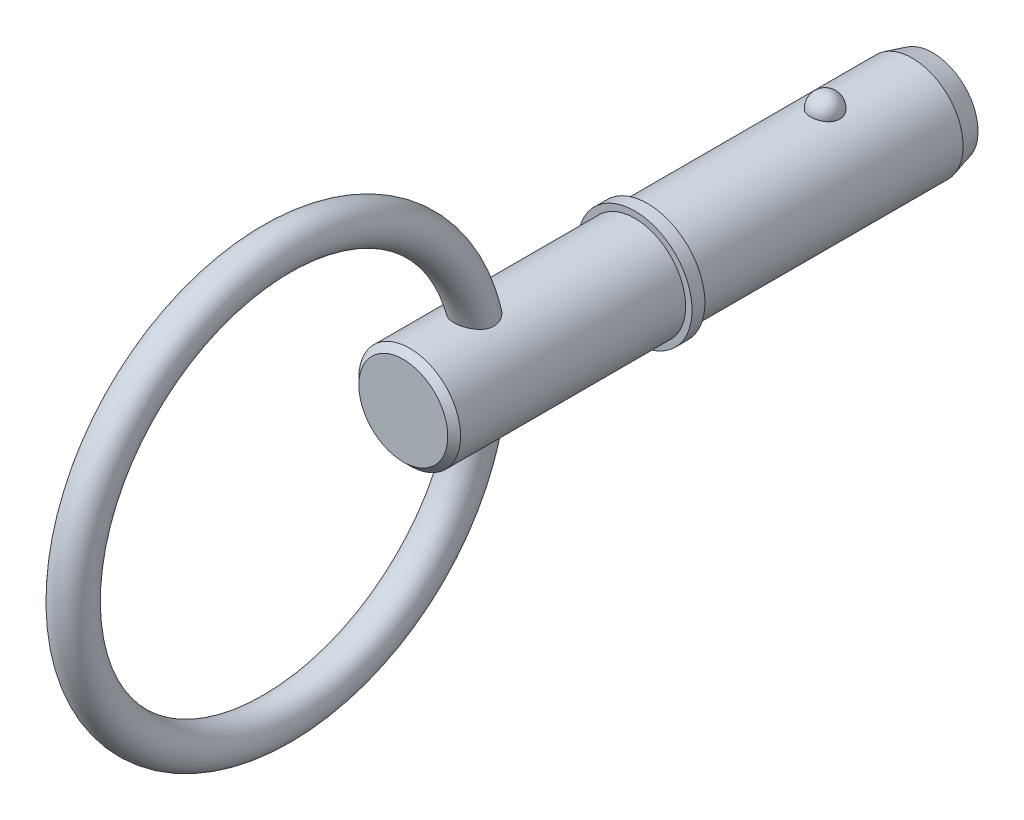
ISO-10303-21;
HEADER;
FILE_DESCRIPTION(('STEP AP214'),'2;1');
FILE_NAME('part.step','',(''),(''),'','','');
FILE_SCHEMA(('AUTOMOTIVE_DESIGN { 1 0 10303 214 1 1 1 1 }'));
ENDSEC;
DATA;
#1=APPLICATION_CONTEXT('core data for automotive mechanical design processes');
#2=APPLICATION_PROTOCOL_DEFINITION('international standard','automotive_design',2000,#1);
#3=PRODUCT_CONTEXT('',#1,'mechanical');
#4=PRODUCT('Part','Part','',(#3));
#5=PRODUCT_RELATED_PRODUCT_CATEGORY('part','',(#4));
#6=PRODUCT_DEFINITION_FORMATION('','',#4);
#7=PRODUCT_DEFINITION_CONTEXT('part definition',#1,'design');
#8=PRODUCT_DEFINITION('design','',#6,#7);
#9=PRODUCT_DEFINITION_SHAPE('','',#8);
#10=(LENGTH_UNIT() NAMED_UNIT(*) SI_UNIT(.MILLI.,.METRE.));
#11=(NAMED_UNIT(*) PLANE_ANGLE_UNIT() SI_UNIT($,.RADIAN.));
#12=(NAMED_UNIT(*) SI_UNIT($,.STERADIAN.) SOLID_ANGLE_UNIT());
#13=UNCERTAINTY_MEASURE_WITH_UNIT(LENGTH_MEASURE(1.E-05),#10,'distance_accuracy_value','');
#14=(GEOMETRIC_REPRESENTATION_CONTEXT(3) GLOBAL_UNCERTAINTY_ASSIGNED_CONTEXT((#13)) GLOBAL_UNIT_ASSIGNED_CONTEXT((#10,
#11,#12)) REPRESENTATION_CONTEXT('',''));
#15=CARTESIAN_POINT('',(0.,0.,0.));
#16=DIRECTION('',(0.,0.,1.));
#17=DIRECTION('',(1.,0.,0.));
#18=AXIS2_PLACEMENT_3D('',#15,#16,#17);
#19=CARTESIAN_POINT('',(0.,0.,12.7));
#20=DIRECTION('',(0.,0.,-1.));
#21=DIRECTION('',(-1.,0.,0.));
#22=AXIS2_PLACEMENT_3D('',#19,#20,#21);
#23=CYLINDRICAL_SURFACE('',#22,3.97);
#24=CARTESIAN_POINT('',(1.13787398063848,3.80343828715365,-1.15000000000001));
#25=CARTESIAN_POINT('',(1.13787307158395,3.80343910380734,-1.08573978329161));
#26=CARTESIAN_POINT('',(1.13264657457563,3.80501406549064,-1.02146820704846));
#27=CARTESIAN_POINT('',(1.11186534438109,3.81113760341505,-0.894749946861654));
#28=CARTESIAN_POINT('',(1.09630734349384,3.81568712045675,-0.832303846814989));
#29=CARTESIAN_POINT('',(1.05525533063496,3.82724281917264,-0.711040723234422));
#30=CARTESIAN_POINT('',(1.02976565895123,3.83424792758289,-0.652222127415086));
#31=CARTESIAN_POINT('',(0.969477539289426,3.84993235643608,-0.539814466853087));
#32=CARTESIAN_POINT('',(0.934679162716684,3.85861166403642,-0.486225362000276));
#33=CARTESIAN_POINT('',(0.856427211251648,3.87673176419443,-0.385470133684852));
#34=CARTESIAN_POINT('',(0.812928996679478,3.88617632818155,-0.338339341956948));
#35=CARTESIAN_POINT('',(0.718506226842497,3.90473543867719,-0.252134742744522));
#36=CARTESIAN_POINT('',(0.667581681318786,3.91384998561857,-0.213060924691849));
#37=CARTESIAN_POINT('',(0.559829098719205,3.93070626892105,-0.144169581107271));
#38=CARTESIAN_POINT('',(0.503019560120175,3.93845211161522,-0.1143241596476));
#39=CARTESIAN_POINT('',(0.384957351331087,3.95173781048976,-0.0645874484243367));
#40=CARTESIAN_POINT('',(0.323705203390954,3.95727792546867,-0.0446949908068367));
#41=CARTESIAN_POINT('',(0.199749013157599,3.96544869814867,-0.0157294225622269));
#42=CARTESIAN_POINT('',(0.137095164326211,3.96813298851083,-0.00645660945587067));
#43=CARTESIAN_POINT('',(0.011061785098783,3.97048461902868,0.00167939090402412));
#44=CARTESIAN_POINT('',(-0.052317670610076,3.97015226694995,0.000543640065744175));
#45=CARTESIAN_POINT('',(-0.176983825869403,3.96653606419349,-0.0120046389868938));
#46=CARTESIAN_POINT('',(-0.238287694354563,3.96329719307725,-0.0232605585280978));
#47=CARTESIAN_POINT('',(-0.358077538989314,3.95427494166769,-0.0555133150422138));
#48=CARTESIAN_POINT('',(-0.41656346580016,3.94849151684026,-0.0765103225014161));
#49=CARTESIAN_POINT('',(-0.529474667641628,3.9349475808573,-0.127824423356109));
#50=CARTESIAN_POINT('',(-0.583873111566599,3.92717527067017,-0.158197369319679));
#51=CARTESIAN_POINT('',(-0.68679616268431,3.9104901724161,-0.227402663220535));
#52=CARTESIAN_POINT('',(-0.73532013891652,3.90157726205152,-0.266235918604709));
#53=CARTESIAN_POINT('',(-0.826197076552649,3.88336108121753,-0.35221079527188));
#54=CARTESIAN_POINT('',(-0.868404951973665,3.87405356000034,-0.399504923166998));
#55=CARTESIAN_POINT('',(-0.944393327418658,3.85623507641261,-0.500572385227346));
#56=CARTESIAN_POINT('',(-0.978173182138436,3.84772417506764,-0.554346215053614));
#57=CARTESIAN_POINT('',(-1.036841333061,3.83233550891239,-0.667624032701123));
#58=CARTESIAN_POINT('',(-1.06161430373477,3.82547928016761,-0.727190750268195));
#59=CARTESIAN_POINT('',(-1.1010562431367,3.81431496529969,-0.849806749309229));
#60=CARTESIAN_POINT('',(-1.11572551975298,3.81000680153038,-0.912855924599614));
#61=CARTESIAN_POINT('',(-1.13455293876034,3.80444307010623,-1.04035299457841));
#62=CARTESIAN_POINT('',(-1.13875701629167,3.80317416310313,-1.10479351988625));
#63=CARTESIAN_POINT('',(-1.13668244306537,3.80379469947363,-1.23348881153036));
#64=CARTESIAN_POINT('',(-1.13040410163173,3.80568404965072,-1.29774358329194));
#65=CARTESIAN_POINT('',(-1.10758455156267,3.81238701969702,-1.42388263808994));
#66=CARTESIAN_POINT('',(-1.09109911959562,3.81718474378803,-1.48577787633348));
#67=CARTESIAN_POINT('',(-1.04831897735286,3.82915360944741,-1.60583632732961));
#68=CARTESIAN_POINT('',(-1.02202385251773,3.83632485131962,-1.66399938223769));
#69=CARTESIAN_POINT('',(-0.960087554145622,3.85229234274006,-1.7753167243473));
#70=CARTESIAN_POINT('',(-0.924393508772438,3.86109769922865,-1.82844028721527));
#71=CARTESIAN_POINT('',(-0.844617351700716,3.87932868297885,-1.92784641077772));
#72=CARTESIAN_POINT('',(-0.800534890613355,3.88875433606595,-1.97412868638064));
#73=CARTESIAN_POINT('',(-0.704909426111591,3.90722138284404,-2.05875748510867));
#74=CARTESIAN_POINT('',(-0.653336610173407,3.91626104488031,-2.09707073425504));
#75=CARTESIAN_POINT('',(-0.544251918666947,3.93290335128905,-2.16444159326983));
#76=CARTESIAN_POINT('',(-0.486740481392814,3.94050610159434,-2.19349988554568));
#77=CARTESIAN_POINT('',(-0.3681866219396,3.95333328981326,-2.24120607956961));
#78=CARTESIAN_POINT('',(-0.307200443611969,3.9585876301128,-2.25998559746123));
#79=CARTESIAN_POINT('',(-0.182787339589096,3.96627905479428,-2.28716436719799));
#80=CARTESIAN_POINT('',(-0.119360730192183,3.96871650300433,-2.29556495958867));
#81=CARTESIAN_POINT('',(0.0067634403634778,3.97048518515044,-2.30167748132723));
#82=CARTESIAN_POINT('',(0.0694499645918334,3.96987797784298,-2.299601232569));
#83=CARTESIAN_POINT('',(0.193555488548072,3.96576491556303,-2.28530777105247));
#84=CARTESIAN_POINT('',(0.254974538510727,3.96225917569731,-2.27309096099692));
#85=CARTESIAN_POINT('',(0.374550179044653,3.95274547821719,-2.2389384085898));
#86=CARTESIAN_POINT('',(0.432719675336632,3.94674835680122,-2.21704472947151));
#87=CARTESIAN_POINT('',(0.544514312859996,3.93288448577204,-2.16414952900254));
#88=CARTESIAN_POINT('',(0.598139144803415,3.92501760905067,-2.13314738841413));
#89=CARTESIAN_POINT('',(0.700284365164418,3.90809781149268,-2.06228741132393));
#90=CARTESIAN_POINT('',(0.748708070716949,3.89902775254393,-2.02229434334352));
#91=CARTESIAN_POINT('',(0.838215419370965,3.88077133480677,-1.93481443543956));
#92=CARTESIAN_POINT('',(0.879297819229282,3.87158495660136,-1.88732632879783));
#93=CARTESIAN_POINT('',(0.953804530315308,3.85391414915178,-1.78516284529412));
#94=CARTESIAN_POINT('',(0.987071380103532,3.8454460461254,-1.73036973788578));
#95=CARTESIAN_POINT('',(1.04410491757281,3.83035507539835,-1.61582422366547));
#96=CARTESIAN_POINT('',(1.06787445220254,3.82373165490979,-1.55607330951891));
#97=CARTESIAN_POINT('',(1.10358064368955,3.813570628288,-1.43904746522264));
#98=CARTESIAN_POINT('',(1.11641754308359,3.80980198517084,-1.38206535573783));
#99=CARTESIAN_POINT('',(1.13356451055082,3.80473547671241,-1.26672526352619));
#100=CARTESIAN_POINT('',(1.13787480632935,3.80343754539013,-1.20836731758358));
#101=CARTESIAN_POINT('',(1.13787398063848,3.80343828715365,-1.15000000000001));
#102=B_SPLINE_CURVE_WITH_KNOTS('',3,(#24,#25,#26,#27,#28,#29,#30,#31,#32,#33,#34,#35,#36,#37,
#38,#39,#40,#41,#42,#43,#44,#45,#46,#47,#48,#49,#50,#51,#52,#53,#54,#55,#56,#57,#58,#59,#60,#61,
#62,#63,#64,#65,#66,#67,#68,#69,#70,#71,#72,#73,#74,#75,#76,#77,#78,#79,#80,#81,#82,#83,#84,#85,
#86,#87,#88,#89,#90,#91,#92,#93,#94,#95,#96,#97,#98,#99,#100,#101),.UNSPECIFIED.,.T.,.F.,(4,2,2,
2,2,2,2,2,2,2,2,2,2,2,2,2,2,2,2,2,2,2,2,2,2,2,2,2,2,2,2,2,2,2,2,2,2,2,4),(0.,0.192571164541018,
0.385203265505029,0.577751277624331,0.770297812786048,0.963858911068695,1.15741975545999,
1.35038964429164,1.54333688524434,1.73259288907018,1.92182958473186,2.10818732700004,
2.2945483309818,2.48204164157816,2.66955507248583,2.86087083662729,3.05220124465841,
3.24590171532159,3.43959628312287,3.63243915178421,3.82527632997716,4.01706893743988,
4.20886965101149,4.40177324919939,4.59468488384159,4.78838651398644,4.9820738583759,
5.17321934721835,5.36434014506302,5.55161251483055,5.7388774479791,5.9253362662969,
6.11180776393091,6.30129785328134,6.49082000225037,6.68388392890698,6.87688993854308,
7.05180628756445,7.22671796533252),.UNSPECIFIED.);
#103=CARTESIAN_POINT('',(1.13787398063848,3.80343828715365,-1.15000000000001));
#104=VERTEX_POINT('',#103);
#105=EDGE_CURVE('E102',#104,#104,#102,.T.);
#106=ORIENTED_EDGE('',*,*,#105,.T.);
#107=EDGE_LOOP('',(#106));
#108=FACE_BOUND('',#107,.T.);
#109=CARTESIAN_POINT('',(0.,0.,-7.94399999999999));
#110=DIRECTION('',(0.,0.,-1.));
#111=DIRECTION('',(-1.,0.,0.));
#112=AXIS2_PLACEMENT_3D('',#109,#110,#111);
#113=CIRCLE('',#112,3.97);
#114=CARTESIAN_POINT('',(-3.97,0.,-7.94399999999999));
#115=VERTEX_POINT('',#114);
#116=EDGE_CURVE('E109',#115,#115,#113,.F.);
#117=ORIENTED_EDGE('',*,*,#116,.T.);
#118=EDGE_LOOP('',(#117));
#119=FACE_BOUND('',#118,.T.);
#120=CARTESIAN_POINT('',(0.,0.,12.7));
#121=DIRECTION('',(0.,0.,1.));
#122=DIRECTION('',(1.,0.,0.));
#123=AXIS2_PLACEMENT_3D('',#120,#121,#122);
#124=CIRCLE('',#123,3.97);
#125=CARTESIAN_POINT('',(3.97,0.,12.7));
#126=VERTEX_POINT('',#125);
#127=EDGE_CURVE('E107',#126,#126,#124,.T.);
#128=ORIENTED_EDGE('',*,*,#127,.F.);
#129=EDGE_LOOP('',(#128));
#130=FACE_BOUND('',#129,.T.);
#131=ADVANCED_FACE('F39',(#108,#119,#130),#23,.T.);
#132=CARTESIAN_POINT('',(0.,0.,-9.53));
#133=DIRECTION('',(0.,0.,-1.));
#134=DIRECTION('',(-1.,0.,0.));
#135=AXIS2_PLACEMENT_3D('',#132,#133,#134);
#136=PLANE('',#135);
#137=CARTESIAN_POINT('',(0.,0.,-9.53));
#138=DIRECTION('',(0.,0.,-1.));
#139=DIRECTION('',(-1.,0.,0.));
#140=AXIS2_PLACEMENT_3D('',#137,#138,#139);
#141=CIRCLE('',#140,3.54503258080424);
#142=CARTESIAN_POINT('',(-3.54503258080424,0.,-9.53));
#143=VERTEX_POINT('',#142);
#144=EDGE_CURVE('E141',#143,#143,#141,.T.);
#145=ORIENTED_EDGE('',*,*,#144,.T.);
#146=EDGE_LOOP('',(#145));
#147=FACE_BOUND('',#146,.T.);
#148=ADVANCED_FACE('F88',(#147),#136,.T.);
#149=CARTESIAN_POINT('',(0.,0.,-9.53));
#150=DIRECTION('',(0.,0.,1.));
#151=DIRECTION('',(1.,0.,0.));
#152=AXIS2_PLACEMENT_3D('',#149,#150,#151);
#153=CONICAL_SURFACE('',#152,3.54503258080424,0.261799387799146);
#154=ORIENTED_EDGE('',*,*,#116,.F.);
#155=EDGE_LOOP('',(#154));
#156=FACE_BOUND('',#155,.T.);
#157=ORIENTED_EDGE('',*,*,#144,.F.);
#158=EDGE_LOOP('',(#157));
#159=FACE_BOUND('',#158,.T.);
#160=ADVANCED_FACE('F94',(#156,#159),#153,.T.);
#161=CARTESIAN_POINT('',(0.,3.97,-1.15000000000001));
#162=DIRECTION('',(0.,1.,0.));
#163=DIRECTION('',(0.,0.,1.));
#164=AXIS2_PLACEMENT_3D('',#161,#162,#163);
#165=SPHERICAL_SURFACE('',#164,1.15);
#166=ORIENTED_EDGE('',*,*,#105,.F.);
#167=EDGE_LOOP('',(#166));
#168=FACE_BOUND('',#167,.T.);
#169=ADVANCED_FACE('F112',(#168),#165,.T.);
#170=CARTESIAN_POINT('',(0.,0.,12.7));
#171=DIRECTION('',(0.,0.,-1.));
#172=DIRECTION('',(-1.,0.,0.));
#173=AXIS2_PLACEMENT_3D('',#170,#171,#172);
#174=PLANE('',#173);
#175=ORIENTED_EDGE('',*,*,#127,.T.);
#176=EDGE_LOOP('',(#175));
#177=FACE_BOUND('',#176,.T.);
#178=CARTESIAN_POINT('',(0.,0.,12.7));
#179=DIRECTION('',(0.,0.,-1.));
#180=DIRECTION('',(-1.,0.,0.));
#181=AXIS2_PLACEMENT_3D('',#178,#179,#180);
#182=CIRCLE('',#181,4.47);
#183=CARTESIAN_POINT('',(-4.47,0.,12.7));
#184=VERTEX_POINT('',#183);
#185=EDGE_CURVE('E108',#184,#184,#182,.T.);
#186=ORIENTED_EDGE('',*,*,#185,.T.);
#187=EDGE_LOOP('',(#186));
#188=FACE_BOUND('',#187,.T.);
#189=ADVANCED_FACE('F116',(#177,#188),#174,.T.);
#190=CARTESIAN_POINT('',(0.,0.,33.7287874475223));
#191=DIRECTION('',(0.,0.,-1.));
#192=DIRECTION('',(-1.,0.,0.));
#193=AXIS2_PLACEMENT_3D('',#190,#191,#192);
#194=CYLINDRICAL_SURFACE('',#193,4.47);
#195=CARTESIAN_POINT('',(0.,0.,13.7));
#196=DIRECTION('',(0.,0.,-1.));
#197=DIRECTION('',(-1.,0.,0.));
#198=AXIS2_PLACEMENT_3D('',#195,#196,#197);
#199=CIRCLE('',#198,4.47);
#200=CARTESIAN_POINT('',(-4.47,0.,13.7));
#201=VERTEX_POINT('',#200);
#202=EDGE_CURVE('E133',#201,#201,#199,.T.);
#203=ORIENTED_EDGE('',*,*,#202,.T.);
#204=EDGE_LOOP('',(#203));
#205=FACE_BOUND('',#204,.T.);
#206=ORIENTED_EDGE('',*,*,#185,.F.);
#207=EDGE_LOOP('',(#206));
#208=FACE_BOUND('',#207,.T.);
#209=ADVANCED_FACE('F120',(#205,#208),#194,.T.);
#210=CARTESIAN_POINT('',(0.,4.47,13.7));
#211=DIRECTION('',(0.,0.,1.));
#212=DIRECTION('',(1.,0.,0.));
#213=AXIS2_PLACEMENT_3D('',#210,#211,#212);
#214=PLANE('',#213);
#215=CARTESIAN_POINT('',(0.,0.,13.7));
#216=DIRECTION('',(0.,0.,1.));
#217=DIRECTION('',(1.,0.,0.));
#218=AXIS2_PLACEMENT_3D('',#215,#216,#217);
#219=CIRCLE('',#218,3.97);
#220=CARTESIAN_POINT('',(3.97,0.,13.7));
#221=VERTEX_POINT('',#220);
#222=EDGE_CURVE('E111',#221,#221,#219,.T.);
#223=ORIENTED_EDGE('',*,*,#222,.F.);
#224=EDGE_LOOP('',(#223));
#225=FACE_BOUND('',#224,.T.);
#226=ORIENTED_EDGE('',*,*,#202,.F.);
#227=EDGE_LOOP('',(#226));
#228=FACE_BOUND('',#227,.T.);
#229=ADVANCED_FACE('F85',(#225,#228),#214,.T.);
#230=CARTESIAN_POINT('',(0.,0.,31.75));
#231=DIRECTION('',(0.,0.,-1.));
#232=DIRECTION('',(-1.,0.,0.));
#233=AXIS2_PLACEMENT_3D('',#230,#231,#232);
#234=CYLINDRICAL_SURFACE('',#233,3.97);
#235=CARTESIAN_POINT('',(-0.740636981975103,-3.90030215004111,24.8942081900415));
#236=CARTESIAN_POINT('',(-0.667733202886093,-3.91414543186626,24.854930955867));
#237=CARTESIAN_POINT('',(-0.591347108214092,-3.92651643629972,24.8215983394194));
#238=CARTESIAN_POINT('',(-0.433709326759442,-3.94703799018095,24.7675410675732));
#239=CARTESIAN_POINT('',(-0.352458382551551,-3.95518918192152,24.7468144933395));
#240=CARTESIAN_POINT('',(-0.187320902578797,-3.96644185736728,24.7184263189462));
#241=CARTESIAN_POINT('',(-0.10343312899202,-3.9695409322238,24.7107709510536));
#242=CARTESIAN_POINT('',(0.0645297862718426,-3.97036376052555,24.7087268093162));
#243=CARTESIAN_POINT('',(0.148604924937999,-3.96808759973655,24.7143378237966));
#244=CARTESIAN_POINT('',(0.313967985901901,-3.95842655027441,24.7386101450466));
#245=CARTESIAN_POINT('',(0.395270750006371,-3.95107581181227,24.7571842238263));
#246=CARTESIAN_POINT('',(0.553418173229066,-3.93204472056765,24.8068699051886));
#247=CARTESIAN_POINT('',(0.630262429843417,-3.92036397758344,24.8379826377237));
#248=CARTESIAN_POINT('',(0.777983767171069,-3.89375421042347,24.9123739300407));
#249=CARTESIAN_POINT('',(0.848809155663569,-3.8788003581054,24.9557462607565));
#250=CARTESIAN_POINT('',(0.981880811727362,-3.84727071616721,25.0536515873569));
#251=CARTESIAN_POINT('',(1.04412630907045,-3.83069478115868,25.1081855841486));
#252=CARTESIAN_POINT('',(1.15846819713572,-3.79768496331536,25.2274397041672));
#253=CARTESIAN_POINT('',(1.21053047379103,-3.78125172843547,25.2921927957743));
#254=CARTESIAN_POINT('',(1.30266807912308,-3.75050988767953,25.4301698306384));
#255=CARTESIAN_POINT('',(1.34274789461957,-3.73620048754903,25.5033905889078));
#256=CARTESIAN_POINT('',(1.40857853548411,-3.71187334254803,25.6536278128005));
#257=CARTESIAN_POINT('',(1.43477198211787,-3.70172571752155,25.7304292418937));
#258=CARTESIAN_POINT('',(1.47426417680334,-3.68617713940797,25.8877211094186));
#259=CARTESIAN_POINT('',(1.48756557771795,-3.68077520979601,25.968210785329));
#260=CARTESIAN_POINT('',(1.5011302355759,-3.67526295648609,26.1282774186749));
#261=CARTESIAN_POINT('',(1.50172918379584,-3.67501639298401,26.2078221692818));
#262=CARTESIAN_POINT('',(1.4912869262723,-3.67926498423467,26.3660010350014));
#263=CARTESIAN_POINT('',(1.48024221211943,-3.68376156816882,26.4446348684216));
#264=CARTESIAN_POINT('',(1.44631002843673,-3.69722026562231,26.6039961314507));
#265=CARTESIAN_POINT('',(1.42273446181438,-3.7064405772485,26.6845537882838));
#266=CARTESIAN_POINT('',(1.36440745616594,-3.72830487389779,26.8410229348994));
#267=CARTESIAN_POINT('',(1.32965006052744,-3.74095068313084,26.9169319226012));
#268=CARTESIAN_POINT('',(1.244983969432,-3.77003365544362,27.0715893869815));
#269=CARTESIAN_POINT('',(1.19374759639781,-3.78674477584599,27.1495625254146));
#270=CARTESIAN_POINT('',(1.07927226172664,-3.82094743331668,27.296060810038));
#271=CARTESIAN_POINT('',(1.01602347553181,-3.83843960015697,27.3645781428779));
#272=CARTESIAN_POINT('',(0.875824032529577,-3.87288453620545,27.4922425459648));
#273=CARTESIAN_POINT('',(0.79844580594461,-3.88979192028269,27.5509375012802));
#274=CARTESIAN_POINT('',(0.63327143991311,-3.92005992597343,27.6524486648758));
#275=CARTESIAN_POINT('',(0.545492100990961,-3.9334261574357,27.6952900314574));
#276=CARTESIAN_POINT('',(0.374503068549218,-3.9531041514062,27.7573026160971));
#277=CARTESIAN_POINT('',(0.292250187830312,-3.96011991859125,27.7788718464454));
#278=CARTESIAN_POINT('',(0.124887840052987,-3.96891507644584,27.8058171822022));
#279=CARTESIAN_POINT('',(0.0397822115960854,-3.97070123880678,27.811214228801));
#280=CARTESIAN_POINT('',(-0.116598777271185,-3.96893737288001,27.8058414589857));
#281=CARTESIAN_POINT('',(-0.187977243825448,-3.96616998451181,27.7974431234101));
#282=CARTESIAN_POINT('',(-0.328224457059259,-3.95703238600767,27.7693459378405));
#283=CARTESIAN_POINT('',(-0.397092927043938,-3.95066177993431,27.7496458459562));
#284=CARTESIAN_POINT('',(-0.530777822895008,-3.93493622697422,27.7000024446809));
#285=CARTESIAN_POINT('',(-0.595585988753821,-3.92557541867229,27.6700390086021));
#286=CARTESIAN_POINT('',(-0.71989020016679,-3.904694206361,27.6012213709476));
#287=CARTESIAN_POINT('',(-0.779384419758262,-3.89317306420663,27.5623641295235));
#288=CARTESIAN_POINT('',(-0.900171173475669,-3.86715924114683,27.4711356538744));
#289=CARTESIAN_POINT('',(-0.960570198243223,-3.85247602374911,27.4176378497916));
#290=CARTESIAN_POINT('',(-1.07286582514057,-3.82272677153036,27.3024377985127));
#291=CARTESIAN_POINT('',(-1.12475588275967,-3.8076604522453,27.2407293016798));
#292=CARTESIAN_POINT('',(-1.22682603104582,-3.77611978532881,27.1003072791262));
#293=CARTESIAN_POINT('',(-1.27547686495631,-3.75979238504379,27.0204426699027));
#294=CARTESIAN_POINT('',(-1.35956460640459,-3.73021138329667,26.8534537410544));
#295=CARTESIAN_POINT('',(-1.39499536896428,-3.71695921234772,26.7663260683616));
#296=CARTESIAN_POINT('',(-1.45224550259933,-3.6949785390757,26.5837644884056));
#297=CARTESIAN_POINT('',(-1.47355906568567,-3.68641985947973,26.4881485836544));
#298=CARTESIAN_POINT('',(-1.49891316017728,-3.67618897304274,26.2943060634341));
#299=CARTESIAN_POINT('',(-1.50297414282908,-3.67450861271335,26.1960826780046));
#300=CARTESIAN_POINT('',(-1.49322338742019,-3.67847743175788,26.0115204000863));
#301=CARTESIAN_POINT('',(-1.48132891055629,-3.68334053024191,25.925062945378));
#302=CARTESIAN_POINT('',(-1.44277978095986,-3.69860964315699,25.7560202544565));
#303=CARTESIAN_POINT('',(-1.4161310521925,-3.70901343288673,25.6734334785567));
#304=CARTESIAN_POINT('',(-1.35164005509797,-3.73296583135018,25.5217432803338));
#305=CARTESIAN_POINT('',(-1.31494998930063,-3.7461693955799,25.4520907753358));
#306=CARTESIAN_POINT('',(-1.23078033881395,-3.77465882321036,25.3201142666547));
#307=CARTESIAN_POINT('',(-1.18329862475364,-3.7899450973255,25.2577917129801));
#308=CARTESIAN_POINT('',(-1.07555346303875,-3.82196646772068,25.138244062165));
#309=CARTESIAN_POINT('',(-1.01467770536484,-3.83873247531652,25.0815789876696));
#310=CARTESIAN_POINT('',(-0.883925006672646,-3.87093079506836,24.979334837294));
#311=CARTESIAN_POINT('',(-0.81404638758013,-3.88636285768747,24.9337578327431));
#312=CARTESIAN_POINT('',(-0.740636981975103,-3.90030215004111,24.8942081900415));
#313=B_SPLINE_CURVE_WITH_KNOTS('',3,(#235,#236,#237,#238,#239,#240,#241,#242,#243,#244,#245,
#246,#247,#248,#249,#250,#251,#252,#253,#254,#255,#256,#257,#258,#259,#260,#261,#262,#263,#264,
#265,#266,#267,#268,#269,#270,#271,#272,#273,#274,#275,#276,#277,#278,#279,#280,#281,#282,#283,
#284,#285,#286,#287,#288,#289,#290,#291,#292,#293,#294,#295,#296,#297,#298,#299,#300,#301,#302,
#303,#304,#305,#306,#307,#308,#309,#310,#311,#312),.UNSPECIFIED.,.T.,.F.,(4,2,2,2,2,2,2,2,2,2,2,
2,2,2,2,2,2,2,2,2,2,2,2,2,2,2,2,2,2,2,2,2,2,2,2,2,2,2,4),(0.,0.251585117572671,
0.503131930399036,0.754798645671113,1.00646134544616,1.2564467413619,1.50645467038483,
1.75842915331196,2.01042624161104,2.26325358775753,2.51598614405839,2.76008726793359,
3.00413815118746,3.24173115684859,3.47939577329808,3.73171171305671,3.9841622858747,
4.26728153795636,4.55063334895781,4.8446962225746,5.1382904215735,5.39265192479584,
5.64668391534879,5.86142364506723,6.07618697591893,6.29137389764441,6.50663447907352,
6.75172833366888,6.99700982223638,7.28055118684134,7.56422418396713,7.85757857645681,
8.15058512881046,8.41135406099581,8.67201836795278,8.9103901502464,9.14880900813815,
9.40209172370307,9.65542171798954),.UNSPECIFIED.);
#314=CARTESIAN_POINT('',(-0.740636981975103,-3.90030215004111,24.8942081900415));
#315=VERTEX_POINT('',#314);
#316=EDGE_CURVE('E10',#315,#315,#313,.T.);
#317=ORIENTED_EDGE('',*,*,#316,.F.);
#318=EDGE_LOOP('',(#317));
#319=FACE_BOUND('',#318,.T.);
#320=CARTESIAN_POINT('',(-0.740636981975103,3.90030215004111,24.8942081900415));
#321=CARTESIAN_POINT('',(-0.813118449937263,3.88653971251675,24.9332571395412));
#322=CARTESIAN_POINT('',(-0.8821496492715,3.8713229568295,24.9781781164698));
#323=CARTESIAN_POINT('',(-1.01146335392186,3.83956738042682,25.0788428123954));
#324=CARTESIAN_POINT('',(-1.07174704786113,3.82302873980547,25.1345850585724));
#325=CARTESIAN_POINT('',(-1.18196955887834,3.79040422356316,25.2557938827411));
#326=CARTESIAN_POINT('',(-1.23189269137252,3.77431906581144,25.321274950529));
#327=CARTESIAN_POINT('',(-1.31978443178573,3.74449359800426,25.4602948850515));
#328=CARTESIAN_POINT('',(-1.35775694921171,3.73075252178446,25.5338311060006));
#329=CARTESIAN_POINT('',(-1.41974909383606,3.7075981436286,25.6847128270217));
#330=CARTESIAN_POINT('',(-1.44413408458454,3.69807309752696,25.7618910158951));
#331=CARTESIAN_POINT('',(-1.4800654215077,3.6838411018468,25.919590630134));
#332=CARTESIAN_POINT('',(-1.49161368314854,3.67913343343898,26.0001115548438));
#333=CARTESIAN_POINT('',(-1.50187378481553,3.67495610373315,26.1602618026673));
#334=CARTESIAN_POINT('',(-1.50086613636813,3.67537197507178,26.2398709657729));
#335=CARTESIAN_POINT('',(-1.48728932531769,3.68088569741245,26.3979172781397));
#336=CARTESIAN_POINT('',(-1.47471654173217,3.68598501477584,26.4763540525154));
#337=CARTESIAN_POINT('',(-1.43761932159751,3.70061780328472,26.6355940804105));
#338=CARTESIAN_POINT('',(-1.41233843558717,3.71042990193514,26.7161940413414));
#339=CARTESIAN_POINT('',(-1.35057314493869,3.73335405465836,26.8724850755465));
#340=CARTESIAN_POINT('',(-1.31408239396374,3.74646797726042,26.9481733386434));
#341=CARTESIAN_POINT('',(-1.2257172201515,3.77636700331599,27.1020428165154));
#342=CARTESIAN_POINT('',(-1.17251505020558,3.79340436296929,27.1794161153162));
#343=CARTESIAN_POINT('',(-1.05406412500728,3.82800923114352,27.3243069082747));
#344=CARTESIAN_POINT('',(-0.988806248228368,3.84557713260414,27.3918168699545));
#345=CARTESIAN_POINT('',(-0.845287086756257,3.87968695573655,27.5162211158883));
#346=CARTESIAN_POINT('',(-0.766724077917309,3.89618874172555,27.5727822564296));
#347=CARTESIAN_POINT('',(-0.599538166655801,3.92537936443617,27.6696962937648));
#348=CARTESIAN_POINT('',(-0.510933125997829,3.93807482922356,27.7100774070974));
#349=CARTESIAN_POINT('',(-0.339677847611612,3.95624165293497,27.7670085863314));
#350=CARTESIAN_POINT('',(-0.257968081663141,3.96248273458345,27.7861280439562));
#351=CARTESIAN_POINT('',(-0.0922002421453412,3.96979198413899,27.8084736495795));
#352=CARTESIAN_POINT('',(-0.00814495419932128,3.97086604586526,27.8117179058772));
#353=CARTESIAN_POINT('',(0.146484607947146,3.96793776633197,27.8027977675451));
#354=CARTESIAN_POINT('',(0.217212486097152,3.96466338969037,27.7928433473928));
#355=CARTESIAN_POINT('',(0.355938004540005,3.95462310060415,27.7618888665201));
#356=CARTESIAN_POINT('',(0.42393529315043,3.94785673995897,27.740887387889));
#357=CARTESIAN_POINT('',(0.556534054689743,3.93137424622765,27.6886148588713));
#358=CARTESIAN_POINT('',(0.621075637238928,3.92161865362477,27.6572059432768));
#359=CARTESIAN_POINT('',(0.74466382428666,3.90004074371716,27.5855756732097));
#360=CARTESIAN_POINT('',(0.803708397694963,3.88821766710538,27.5453510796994));
#361=CARTESIAN_POINT('',(0.923664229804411,3.86161149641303,27.4510569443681));
#362=CARTESIAN_POINT('',(0.983622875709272,3.84664723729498,27.3958282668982));
#363=CARTESIAN_POINT('',(1.09477654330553,3.81650197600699,27.2771942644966));
#364=CARTESIAN_POINT('',(1.14596459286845,3.80132081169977,27.2137825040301));
#365=CARTESIAN_POINT('',(1.24603510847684,3.76980809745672,27.0699890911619));
#366=CARTESIAN_POINT('',(1.29338223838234,3.753652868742,26.9884933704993));
#367=CARTESIAN_POINT('',(1.37450267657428,3.72471527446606,26.8183960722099));
#368=CARTESIAN_POINT('',(1.40827109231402,3.71193412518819,26.7297919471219));
#369=CARTESIAN_POINT('',(1.46140533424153,3.6913461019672,26.5455436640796));
#370=CARTESIAN_POINT('',(1.48042991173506,3.6836576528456,26.4497859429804));
#371=CARTESIAN_POINT('',(1.50115029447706,3.67526750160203,26.2561286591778));
#372=CARTESIAN_POINT('',(1.50286713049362,3.67455732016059,26.1582318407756));
#373=CARTESIAN_POINT('',(1.48878143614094,3.68028077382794,25.9752085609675));
#374=CARTESIAN_POINT('',(1.47496153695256,3.68590609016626,25.8899028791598));
#375=CARTESIAN_POINT('',(1.43287242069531,3.70247002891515,25.7234763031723));
#376=CARTESIAN_POINT('',(1.40460762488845,3.7134070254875,25.6423541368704));
#377=CARTESIAN_POINT('',(1.33714680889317,3.7381964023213,25.4931046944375));
#378=CARTESIAN_POINT('',(1.2989833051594,3.75175245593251,25.4244572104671));
#379=CARTESIAN_POINT('',(1.21206000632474,3.78072797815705,25.2946829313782));
#380=CARTESIAN_POINT('',(1.16329942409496,3.79614758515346,25.2335566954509));
#381=CARTESIAN_POINT('',(1.05526740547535,3.82760231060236,25.1188656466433));
#382=CARTESIAN_POINT('',(0.995782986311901,3.84364346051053,25.0655033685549));
#383=CARTESIAN_POINT('',(0.86865178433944,3.8743538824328,24.9690998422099));
#384=CARTESIAN_POINT('',(0.801003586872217,3.88902291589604,24.9260603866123));
#385=CARTESIAN_POINT('',(0.656696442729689,3.91602140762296,24.8497891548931));
#386=CARTESIAN_POINT('',(0.579799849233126,3.92824686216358,24.8169691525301));
#387=CARTESIAN_POINT('',(0.421219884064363,3.94839960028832,24.7640374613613));
#388=CARTESIAN_POINT('',(0.339536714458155,3.95632706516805,24.7439252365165));
#389=CARTESIAN_POINT('',(0.173681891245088,3.96706909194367,24.7168661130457));
#390=CARTESIAN_POINT('',(0.0895101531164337,3.96988347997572,24.7099196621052));
#391=CARTESIAN_POINT('',(-0.0788915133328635,3.97010941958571,24.7093589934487));
#392=CARTESIAN_POINT('',(-0.163121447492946,3.96752031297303,24.7157463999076));
#393=CARTESIAN_POINT('',(-0.332911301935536,3.9569711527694,24.7422872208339));
#394=CARTESIAN_POINT('',(-0.418363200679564,3.94877687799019,24.7630414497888));
#395=CARTESIAN_POINT('',(-0.584033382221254,3.92769448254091,24.8184250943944));
#396=CARTESIAN_POINT('',(-0.66425117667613,3.91480592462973,24.8530558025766));
#397=CARTESIAN_POINT('',(-0.740636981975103,3.90030215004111,24.8942081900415));
#398=B_SPLINE_CURVE_WITH_KNOTS('',3,(#320,#321,#322,#323,#324,#325,#326,#327,#328,#329,#330,
#331,#332,#333,#334,#335,#336,#337,#338,#339,#340,#341,#342,#343,#344,#345,#346,#347,#348,#349,
#350,#351,#352,#353,#354,#355,#356,#357,#358,#359,#360,#361,#362,#363,#364,#365,#366,#367,#368,
#369,#370,#371,#372,#373,#374,#375,#376,#377,#378,#379,#380,#381,#382,#383,#384,#385,#386,#387,
#388,#389,#390,#391,#392,#393,#394,#395,#396,#397),.UNSPECIFIED.,.T.,.F.,(4,2,2,2,2,2,2,2,2,2,2,
2,2,2,2,2,2,2,2,2,2,2,2,2,2,2,2,2,2,2,2,2,2,2,2,2,2,2,4),(0.,0.25011587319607,0.500197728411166,
0.75065545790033,1.00103116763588,1.24430196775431,1.48753646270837,1.72534678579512,
1.96323159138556,2.21733609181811,2.47158471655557,2.75662009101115,3.04187201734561,
3.3347718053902,3.62715855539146,3.87803518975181,4.12862559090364,4.34211896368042,
4.55563974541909,4.77211030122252,4.98866052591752,5.23635199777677,5.48423946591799,
5.76983687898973,6.05553710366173,6.3476672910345,6.63944246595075,6.89782349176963,
7.15612548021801,7.39414671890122,7.63218564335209,7.87561406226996,8.11908472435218,
8.37137533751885,8.62365530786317,8.87594385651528,9.12826313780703,9.39182737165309,
9.65541616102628),.UNSPECIFIED.);
#399=CARTESIAN_POINT('',(-0.740636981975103,3.90030215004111,24.8942081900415));
#400=VERTEX_POINT('',#399);
#401=EDGE_CURVE('E51',#400,#400,#398,.T.);
#402=ORIENTED_EDGE('',*,*,#401,.F.);
#403=EDGE_LOOP('',(#402));
#404=FACE_BOUND('',#403,.T.);
#405=CARTESIAN_POINT('',(0.,0.,31.25));
#406=DIRECTION('',(0.,0.,-1.));
#407=DIRECTION('',(-1.,0.,0.));
#408=AXIS2_PLACEMENT_3D('',#405,#406,#407);
#409=CIRCLE('',#408,3.97);
#410=CARTESIAN_POINT('',(-3.97,0.,31.25));
#411=VERTEX_POINT('',#410);
#412=EDGE_CURVE('E64',#411,#411,#409,.T.);
#413=ORIENTED_EDGE('',*,*,#412,.T.);
#414=EDGE_LOOP('',(#413));
#415=FACE_BOUND('',#414,.T.);
#416=ORIENTED_EDGE('',*,*,#222,.T.);
#417=EDGE_LOOP('',(#416));
#418=FACE_BOUND('',#417,.T.);
#419=ADVANCED_FACE('F69',(#319,#404,#415,#418),#234,.T.);
#420=CARTESIAN_POINT('',(0.,0.,31.75));
#421=DIRECTION('',(0.,0.,-1.));
#422=DIRECTION('',(-1.,0.,0.));
#423=AXIS2_PLACEMENT_3D('',#420,#421,#422);
#424=PLANE('',#423);
#425=CARTESIAN_POINT('',(0.,0.,31.75));
#426=DIRECTION('',(0.,0.,-1.));
#427=DIRECTION('',(-1.,0.,0.));
#428=AXIS2_PLACEMENT_3D('',#425,#426,#427);
#429=CIRCLE('',#428,3.46999999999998);
#430=CARTESIAN_POINT('',(-3.46999999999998,0.,31.75));
#431=VERTEX_POINT('',#430);
#432=EDGE_CURVE('E58',#431,#431,#429,.F.);
#433=ORIENTED_EDGE('',*,*,#432,.T.);
#434=EDGE_LOOP('',(#433));
#435=FACE_BOUND('',#434,.T.);
#436=ADVANCED_FACE('F76',(#435),#424,.F.);
#437=CARTESIAN_POINT('',(0.,0.,31.25));
#438=DIRECTION('',(0.,0.,-1.));
#439=DIRECTION('',(-1.,0.,0.));
#440=AXIS2_PLACEMENT_3D('',#437,#438,#439);
#441=CONICAL_SURFACE('',#440,3.97,0.785398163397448);
#442=ORIENTED_EDGE('',*,*,#432,.F.);
#443=EDGE_LOOP('',(#442));
#444=FACE_BOUND('',#443,.T.);
#445=ORIENTED_EDGE('',*,*,#412,.F.);
#446=EDGE_LOOP('',(#445));
#447=FACE_BOUND('',#446,.T.);
#448=ADVANCED_FACE('F41',(#444,#447),#441,.T.);
#449=CARTESIAN_POINT('',(0.,0.,41.625));
#450=DIRECTION('',(1.,0.,0.));
#451=DIRECTION('',(0.,0.,-1.));
#452=AXIS2_PLACEMENT_3D('',#449,#450,#451);
#453=TOROIDAL_SURFACE('',#452,15.875,1.5);
#454=ORIENTED_EDGE('',*,*,#316,.T.);
#455=EDGE_LOOP('',(#454));
#456=FACE_BOUND('',#455,.T.);
#457=ORIENTED_EDGE('',*,*,#401,.T.);
#458=EDGE_LOOP('',(#457));
#459=FACE_BOUND('',#458,.T.);
#460=ADVANCED_FACE('F73',(#456,#459),#453,.T.);
#461=CLOSED_SHELL('',(#131,#148,#160,#169,#189,#209,#229,#419,#436,#448,#460));
#462=MANIFOLD_SOLID_BREP('B2',#461);
#463=ADVANCED_BREP_SHAPE_REPRESENTATION('',(#18,#462),#14);
#464=SHAPE_DEFINITION_REPRESENTATION(#9,#463);
ENDSEC;
END-ISO-10303-21;
